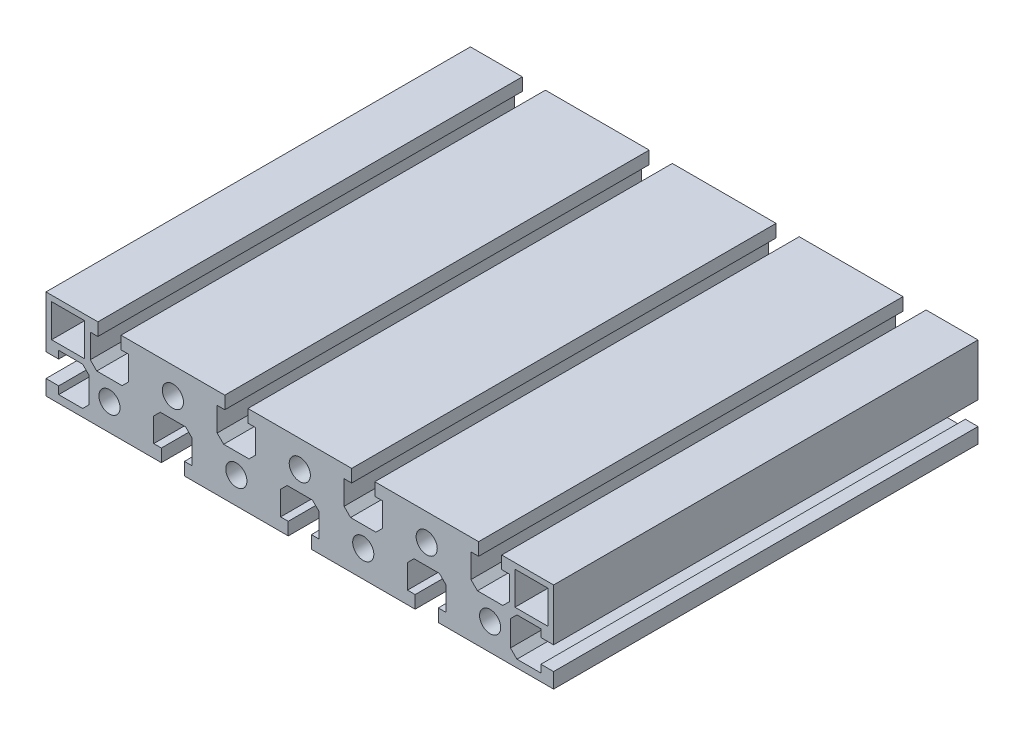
from build123d import *

# Parameters (mm, degrees)
EXTRUDE1_DEPTH      = 75.25
EXTRUDE1_DEPTH_BACK = 75.25
SKETCH1_R           = 3.75
SKETCH1_W           = 11.699951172
SKETCH1_H           = 11.700012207


with BuildPart() as part:
    # Sketch1 → Extrude1 (new, two sides: drawn at the far end of the back side and taken through both)
    with BuildSketch(Plane.XY.offset(-EXTRUDE1_DEPTH_BACK)):
        Polygon((-74.3, 18), (-71.6, 18), (-71.6, 22.5), (-90, 22.5), (-90, 4.1), (-85.5, 4.1), (-85.5, 6.8), (-77, 6.8), (-74.7, 4.5), (-74.7, -4.5), (-77, -6.8), (-85.5, -6.8), (-85.5, -4.1), (-90, -4.1), (-90, -9.5), (-49.1, -9.5), (-49.1, -5), (-51.8, -5), (-51.8, 3.5), (-49.5, 5.8), (-40.5, 5.8), (-38.2, 3.5), (-38.2, -5), (-40.9, -5), (-40.9, -9.5), (-4.1, -9.5), (-4.1, -5), (-6.8, -5), (-6.8, 3.5), (-4.5, 5.8), (4.5, 5.8), (6.8, 3.5), (6.8, -5), (4.1, -5), (4.1, -9.5), (40.9, -9.5), (40.9, -5), (38.2, -5), (38.2, 3.5), (40.5, 5.8), (49.5, 5.8), (51.8, 3.5), (51.8, -5), (49.1, -5), (49.1, -9.5), (90, -9.5), (90, -4.1), (85.5, -4.1), (85.5, -6.8), (77, -6.8), (74.7, -4.5), (74.7, 4.5), (77, 6.8), (85.5, 6.8), (85.5, 4.1), (90, 4.1), (90, 22.5), (71.6, 22.5), (71.6, 18), (74.3, 18), (74.3, 9.5), (72, 7.2), (63, 7.2), (60.7, 9.5), (60.7, 18), (63.4, 18), (63.4, 22.5), (26.6, 22.5), (26.6, 18), (29.3, 18), (29.3, 9.5), (27, 7.2), (18, 7.2), (15.7, 9.5), (15.7, 18), (18.4, 18), (18.4, 22.5), (-18.4, 22.5), (-18.4, 18), (-15.7, 18), (-15.7, 9.5), (-18, 7.2), (-27, 7.2), (-29.3, 9.5), (-29.3, 18), (-26.6, 18), (-26.6, 22.5), (-63.4, 22.5), (-63.4, 18), (-60.7, 18), (-60.7, 9.5), (-63, 7.2), (-72, 7.2), (-74.3, 9.5), align=None)
        with Locations((67.5, 0)):
            Circle(SKETCH1_R, mode=Mode.SUBTRACT)
        with Locations((45, 13)):
            Circle(SKETCH1_R, mode=Mode.SUBTRACT)
        with Locations((22.5, 0)):
            Circle(SKETCH1_R, mode=Mode.SUBTRACT)
        with Locations((0, 13)):
            Circle(SKETCH1_R, mode=Mode.SUBTRACT)
        with Locations((-22.5, 0)):
            Circle(SKETCH1_R, mode=Mode.SUBTRACT)
        with Locations((-45, 13)):
            Circle(SKETCH1_R, mode=Mode.SUBTRACT)
        with Locations((-67.5, 0)):
            Circle(SKETCH1_R, mode=Mode.SUBTRACT)
        with Locations((82.149975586, 14.649993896)):
            Rectangle(SKETCH1_W, SKETCH1_H, mode=Mode.SUBTRACT)
        with Locations((-82.150024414, 14.649993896)):
            Rectangle(SKETCH1_W, SKETCH1_H, mode=Mode.SUBTRACT)
    extrude(amount=EXTRUDE1_DEPTH + EXTRUDE1_DEPTH_BACK)


solid = part.part
